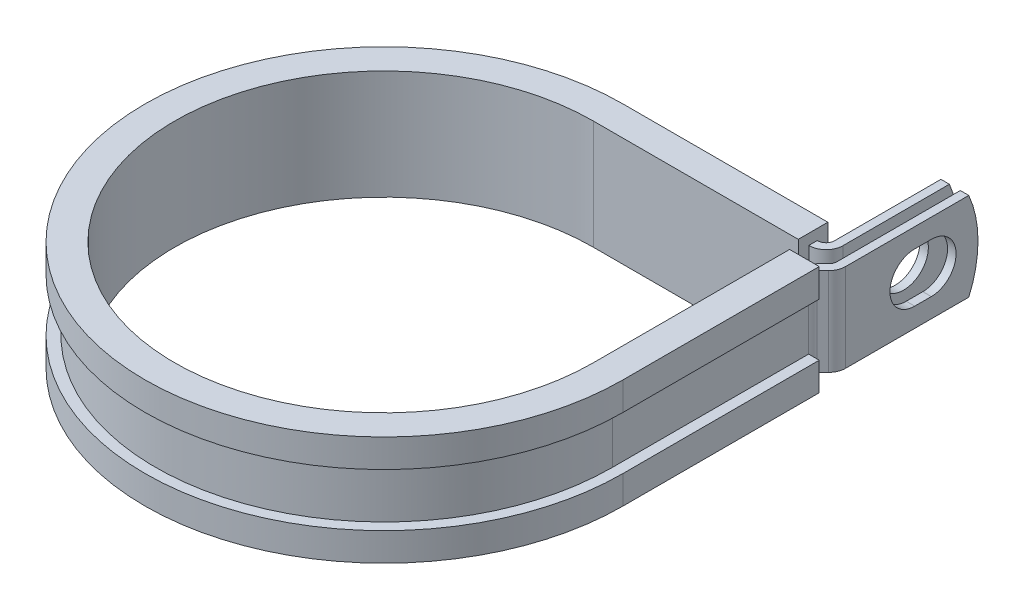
from build123d import *

# Parameters (mm, degrees)
EXTRUDE_THIN1_DEPTH = 6.35
SKETCH2_R           = 3.5687
CUT_EXTRUDE1_DEPTH  = 1.2192
CUT_EXTRUDE2_DEPTH  = 1.2192
CUT_EXTRUDE3_DEPTH  = 82.703860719


with BuildPart() as part:
    # Sketch1 → Extrude-Thin1 (new, symmetric)
    with BuildSketch(Plane(origin=(0, 0, 0), x_dir=(1, 0, 0), z_dir=(0, 1, 0))):
        with BuildLine():
            Line((33.5839698, 50.7746), (33.5839698, 31.6865))
            ThreePointArc((33.5839698, 31.6865), (33.491163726, 31.219932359), (33.226874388, 30.824395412))
            Line((33.226874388, 30.824395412), (32.400690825, 29.998211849))
            ThreePointArc((32.400690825, 29.998211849), (31.872112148, 29.207137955), (31.6865, 28.274002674))
            Line((31.6865, 28.274002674), (31.6865, 0))
            ThreePointArc((31.6865, 0), (-22.405739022, -22.405739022), (0, 31.6865))
            Line((0, 31.6865), (29.5707698, 31.6865))
            ThreePointArc((29.5707698, 31.6865), (31.294978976, 32.400690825), (32.0091698, 34.1249))
            Line((32.0091698, 34.1249), (32.0091698, 50.7746))
            Line((32.0091698, 50.7746), (30.7899698, 50.7746))
            Line((30.7899698, 50.7746), (30.7899698, 34.1249))
            ThreePointArc((30.7899698, 34.1249), (30.432874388, 33.262795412), (29.5707698, 32.9057))
            Line((29.5707698, 32.9057), (0, 32.9057))
            ThreePointArc((0, 32.9057), (-23.26784361, -23.26784361), (32.9057, 0))
            Line((32.9057, 0), (32.9057, 28.274002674))
            ThreePointArc((32.9057, 28.274002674), (32.998506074, 28.740570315), (33.262795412, 29.136107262))
            Line((33.262795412, 29.136107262), (34.088978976, 29.962290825))
            ThreePointArc((34.088978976, 29.962290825), (34.617557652, 30.753364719), (34.8031698, 31.6865))
            Line((34.8031698, 31.6865), (34.8031698, 50.7746))
            Line((34.8031698, 50.7746), (33.5839698, 50.7746))
        make_face()
    extrude(amount=EXTRUDE_THIN1_DEPTH, both=True)

    # Sketch2 → Cut-Extrude1 (cut)
    with BuildSketch(Plane.ZY.offset(-30.7899698)):
        with Locations((-42.8498, 0)):
            Circle(SKETCH2_R)
    extrude(amount=-CUT_EXTRUDE1_DEPTH, mode=Mode.SUBTRACT)

    # Sketch3 → Cut-Extrude2 (cut)
    with BuildSketch(Plane(origin=(34.8031698, 0, 0), x_dir=(0, 0, -1), z_dir=(1, 0, 0))):
        with BuildLine():
            Line((41.656, 3.5687), (44.0436, 3.5687))
            ThreePointArc((44.0436, 3.5687), (47.6123, 0), (44.0436, -3.5687))
            Line((44.0436, -3.5687), (41.656, -3.5687))
            ThreePointArc((41.656, -3.5687), (38.0873, 0), (41.656, 3.5687))
        make_face()
    extrude(amount=-CUT_EXTRUDE2_DEPTH, mode=Mode.SUBTRACT)

    # Sketch4 → Cut-Extrude3 (cut, through all)
    with BuildSketch(Plane.ZY.offset(-30.7899698)):
        with BuildLine():
            Line((-49.449277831, 6.35), (-50.7746, 6.35))
            Line((-50.7746, 6.35), (-50.7746, 0))
            ThreePointArc((-50.7746, 0), (-50.439737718, 3.243415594), (-49.449277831, 6.35))
        make_face()
        with BuildLine():
            ThreePointArc((-49.449277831, -6.35), (-50.439737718, -3.243415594), (-50.7746, 0))
            Line((-50.7746, 0), (-50.7746, -6.35))
            Line((-50.7746, -6.35), (-49.449277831, -6.35))
        make_face()
    extrude(amount=-CUT_EXTRUDE3_DEPTH, mode=Mode.SUBTRACT)

    # Sweep1: sweep along a path in Sketch6
    with BuildLine(Plane(origin=(0, 6.35, 0), x_dir=(1, 0, 0), z_dir=(0, 1, 0))) as sweep1_path:
        Line((30.1625, 28.274002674), (30.1625, 0))
        ThreePointArc((30.1625, 0), (-21.328108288, -21.328108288), (0, 30.1625))
        Line((0, 30.1625), (29.5199698, 30.1625))
    # Sketch5 → Sweep1 (sweep)
    with BuildSketch(Plane(origin=(0, 0, -28.274002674), x_dir=(-1, 0, 0), z_dir=(0, 0, -1))):
        Polygon((-32.9057, 6.35), (-31.6865, 6.35), (-31.6865, -6.35), (-32.9057, -6.35), (-32.9057, -3.81), (-34.4297, -3.81), (-34.4297, -7.874), (-30.1625, -7.874), (-30.1625, 7.874), (-34.4297, 7.874), (-34.4297, 3.81), (-32.9057, 3.81), align=None)
    sweep(path=sweep1_path.line)


solid = part.part
